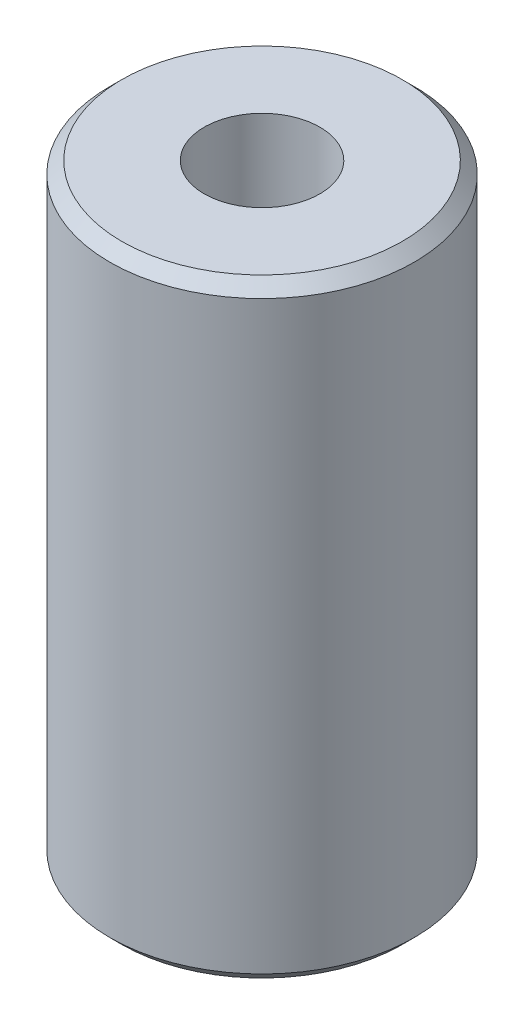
from build123d import *

# Parameters (mm, degrees)
SKETCH1_R              = 6.35
EXTRUDE1_DEPTH         = 25.4
CHAMFER1_SIZE          = 0.5
F_10_32_TAPPED_HOLE1_D = 4.826


with BuildPart() as part:
    # Sketch1 → Extrude1 (new body)
    with BuildSketch(Plane(origin=(0, 0, 0), x_dir=(1, 0, 0), z_dir=(0, 1, 0))):
        with Locations(Location((0, 0, 0), (0, 0, 270))):
            Circle(SKETCH1_R)
    extrude(amount=-EXTRUDE1_DEPTH)

    # Chamfer1
    chamfer1_edges = [part.edges().sort_by_distance(p)[0] for p in [
        (0, 0, -6.35),
        (0, -25.4, -6.35),
    ]]
    chamfer(chamfer1_edges, length=CHAMFER1_SIZE)

    # 10-32 Tapped Hole1 (through all)
    with Locations(Plane.ZX):
        with Locations((0, 0)):
            Hole(F_10_32_TAPPED_HOLE1_D / 2)


solid = part.part
